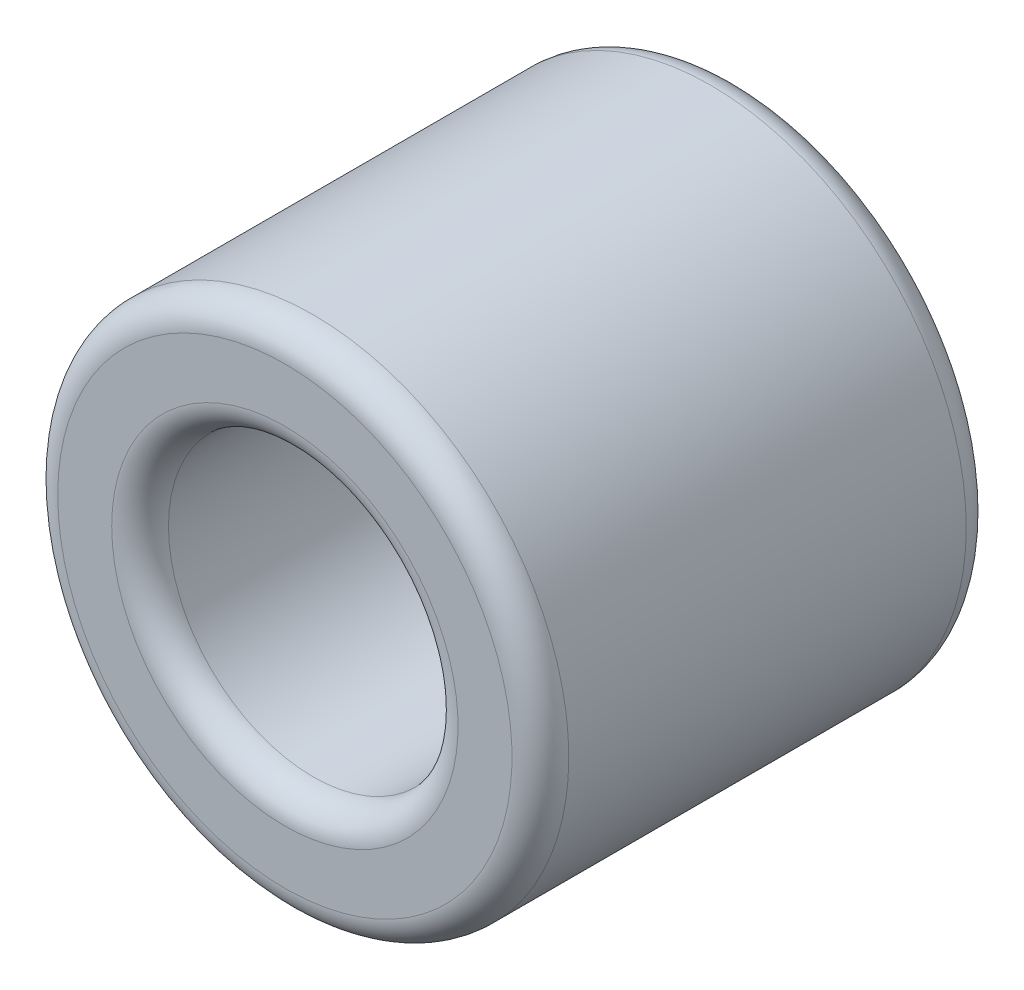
ISO-10303-21;
HEADER;
FILE_DESCRIPTION(('STEP AP214'),'2;1');
FILE_NAME('part.step','',(''),(''),'','','');
FILE_SCHEMA(('AUTOMOTIVE_DESIGN { 1 0 10303 214 1 1 1 1 }'));
ENDSEC;
DATA;
#1=APPLICATION_CONTEXT('core data for automotive mechanical design processes');
#2=APPLICATION_PROTOCOL_DEFINITION('international standard','automotive_design',2000,#1);
#3=PRODUCT_CONTEXT('',#1,'mechanical');
#4=PRODUCT('Part','Part','',(#3));
#5=PRODUCT_RELATED_PRODUCT_CATEGORY('part','',(#4));
#6=PRODUCT_DEFINITION_FORMATION('','',#4);
#7=PRODUCT_DEFINITION_CONTEXT('part definition',#1,'design');
#8=PRODUCT_DEFINITION('design','',#6,#7);
#9=PRODUCT_DEFINITION_SHAPE('','',#8);
#10=(LENGTH_UNIT() NAMED_UNIT(*) SI_UNIT(.MILLI.,.METRE.));
#11=(NAMED_UNIT(*) PLANE_ANGLE_UNIT() SI_UNIT($,.RADIAN.));
#12=(NAMED_UNIT(*) SI_UNIT($,.STERADIAN.) SOLID_ANGLE_UNIT());
#13=UNCERTAINTY_MEASURE_WITH_UNIT(LENGTH_MEASURE(1.E-05),#10,'distance_accuracy_value','');
#14=(GEOMETRIC_REPRESENTATION_CONTEXT(3) GLOBAL_UNCERTAINTY_ASSIGNED_CONTEXT((#13)) GLOBAL_UNIT_ASSIGNED_CONTEXT((#10,
#11,#12)) REPRESENTATION_CONTEXT('',''));
#15=CARTESIAN_POINT('',(0.,0.,0.));
#16=DIRECTION('',(0.,0.,1.));
#17=DIRECTION('',(1.,0.,0.));
#18=AXIS2_PLACEMENT_3D('',#15,#16,#17);
#19=CARTESIAN_POINT('',(0.,4.5,4.));
#20=DIRECTION('',(0.,0.,-1.));
#21=DIRECTION('',(-1.,0.,0.));
#22=AXIS2_PLACEMENT_3D('',#19,#20,#21);
#23=PLANE('',#22);
#24=CARTESIAN_POINT('',(0.,0.,4.));
#25=DIRECTION('',(0.,0.,-1.));
#26=DIRECTION('',(-1.,0.,0.));
#27=AXIS2_PLACEMENT_3D('',#24,#25,#26);
#28=CIRCLE('',#27,4.);
#29=CARTESIAN_POINT('',(-4.,0.,4.));
#30=VERTEX_POINT('',#29);
#31=EDGE_CURVE('E40',#30,#30,#28,.F.);
#32=ORIENTED_EDGE('',*,*,#31,.T.);
#33=EDGE_LOOP('',(#32));
#34=FACE_BOUND('',#33,.T.);
#35=CARTESIAN_POINT('',(0.,0.,4.));
#36=DIRECTION('',(0.,0.,-1.));
#37=DIRECTION('',(-1.,0.,0.));
#38=AXIS2_PLACEMENT_3D('',#35,#36,#37);
#39=CIRCLE('',#38,3.05);
#40=CARTESIAN_POINT('',(-3.05,0.,4.));
#41=VERTEX_POINT('',#40);
#42=EDGE_CURVE('E44',#41,#41,#39,.T.);
#43=ORIENTED_EDGE('',*,*,#42,.T.);
#44=EDGE_LOOP('',(#43));
#45=FACE_BOUND('',#44,.T.);
#46=ADVANCED_FACE('F29',(#34,#45),#23,.F.);
#47=CARTESIAN_POINT('',(0.,0.,4.));
#48=DIRECTION('',(0.,0.,1.));
#49=DIRECTION('',(1.,0.,0.));
#50=AXIS2_PLACEMENT_3D('',#47,#48,#49);
#51=CYLINDRICAL_SURFACE('',#50,2.55);
#52=CARTESIAN_POINT('',(0.,0.,3.5));
#53=DIRECTION('',(0.,0.,-1.));
#54=DIRECTION('',(-1.,0.,0.));
#55=AXIS2_PLACEMENT_3D('',#52,#53,#54);
#56=CIRCLE('',#55,2.55);
#57=CARTESIAN_POINT('',(-2.55,0.,3.5));
#58=VERTEX_POINT('',#57);
#59=EDGE_CURVE('E10',#58,#58,#56,.F.);
#60=ORIENTED_EDGE('',*,*,#59,.T.);
#61=EDGE_LOOP('',(#60));
#62=FACE_BOUND('',#61,.T.);
#63=CARTESIAN_POINT('',(0.,0.,-3.5));
#64=DIRECTION('',(0.,0.,1.));
#65=DIRECTION('',(1.,0.,0.));
#66=AXIS2_PLACEMENT_3D('',#63,#64,#65);
#67=CIRCLE('',#66,2.55);
#68=CARTESIAN_POINT('',(2.55,0.,-3.5));
#69=VERTEX_POINT('',#68);
#70=EDGE_CURVE('E36',#69,#69,#67,.F.);
#71=ORIENTED_EDGE('',*,*,#70,.T.);
#72=EDGE_LOOP('',(#71));
#73=FACE_BOUND('',#72,.T.);
#74=ADVANCED_FACE('F74',(#62,#73),#51,.F.);
#75=CARTESIAN_POINT('',(0.,2.55,-4.));
#76=DIRECTION('',(0.,0.,1.));
#77=DIRECTION('',(1.,0.,0.));
#78=AXIS2_PLACEMENT_3D('',#75,#76,#77);
#79=PLANE('',#78);
#80=CARTESIAN_POINT('',(0.,0.,-4.));
#81=DIRECTION('',(0.,0.,1.));
#82=DIRECTION('',(1.,0.,0.));
#83=AXIS2_PLACEMENT_3D('',#80,#81,#82);
#84=CIRCLE('',#83,4.);
#85=CARTESIAN_POINT('',(4.,0.,-4.));
#86=VERTEX_POINT('',#85);
#87=EDGE_CURVE('E49',#86,#86,#84,.F.);
#88=ORIENTED_EDGE('',*,*,#87,.T.);
#89=EDGE_LOOP('',(#88));
#90=FACE_BOUND('',#89,.T.);
#91=CARTESIAN_POINT('',(0.,0.,-4.));
#92=DIRECTION('',(0.,0.,1.));
#93=DIRECTION('',(1.,0.,0.));
#94=AXIS2_PLACEMENT_3D('',#91,#92,#93);
#95=CIRCLE('',#94,3.05);
#96=CARTESIAN_POINT('',(3.05,0.,-4.));
#97=VERTEX_POINT('',#96);
#98=EDGE_CURVE('E52',#97,#97,#95,.T.);
#99=ORIENTED_EDGE('',*,*,#98,.T.);
#100=EDGE_LOOP('',(#99));
#101=FACE_BOUND('',#100,.T.);
#102=ADVANCED_FACE('F90',(#90,#101),#79,.F.);
#103=CARTESIAN_POINT('',(0.,0.,4.));
#104=DIRECTION('',(0.,0.,1.));
#105=DIRECTION('',(1.,0.,0.));
#106=AXIS2_PLACEMENT_3D('',#103,#104,#105);
#107=CYLINDRICAL_SURFACE('',#106,4.5);
#108=CARTESIAN_POINT('',(0.,0.,-3.5));
#109=DIRECTION('',(0.,0.,1.));
#110=DIRECTION('',(1.,0.,0.));
#111=AXIS2_PLACEMENT_3D('',#108,#109,#110);
#112=CIRCLE('',#111,4.5);
#113=CARTESIAN_POINT('',(4.5,0.,-3.5));
#114=VERTEX_POINT('',#113);
#115=EDGE_CURVE('E55',#114,#114,#112,.T.);
#116=ORIENTED_EDGE('',*,*,#115,.T.);
#117=EDGE_LOOP('',(#116));
#118=FACE_BOUND('',#117,.T.);
#119=CARTESIAN_POINT('',(0.,0.,3.5));
#120=DIRECTION('',(0.,0.,-1.));
#121=DIRECTION('',(-1.,0.,0.));
#122=AXIS2_PLACEMENT_3D('',#119,#120,#121);
#123=CIRCLE('',#122,4.5);
#124=CARTESIAN_POINT('',(-4.5,0.,3.5));
#125=VERTEX_POINT('',#124);
#126=EDGE_CURVE('E58',#125,#125,#123,.T.);
#127=ORIENTED_EDGE('',*,*,#126,.T.);
#128=EDGE_LOOP('',(#127));
#129=FACE_BOUND('',#128,.T.);
#130=ADVANCED_FACE('F62',(#118,#129),#107,.T.);
#131=CARTESIAN_POINT('',(0.,0.,-3.5));
#132=DIRECTION('',(0.,0.,1.));
#133=DIRECTION('',(1.,0.,0.));
#134=AXIS2_PLACEMENT_3D('',#131,#132,#133);
#135=TOROIDAL_SURFACE('',#134,4.,0.5);
#136=ORIENTED_EDGE('',*,*,#87,.F.);
#137=EDGE_LOOP('',(#136));
#138=FACE_BOUND('',#137,.T.);
#139=ORIENTED_EDGE('',*,*,#115,.F.);
#140=EDGE_LOOP('',(#139));
#141=FACE_BOUND('',#140,.T.);
#142=ADVANCED_FACE('F68',(#138,#141),#135,.T.);
#143=CARTESIAN_POINT('',(0.,0.,3.5));
#144=DIRECTION('',(0.,0.,-1.));
#145=DIRECTION('',(-1.,0.,0.));
#146=AXIS2_PLACEMENT_3D('',#143,#144,#145);
#147=TOROIDAL_SURFACE('',#146,4.,0.5);
#148=ORIENTED_EDGE('',*,*,#126,.F.);
#149=EDGE_LOOP('',(#148));
#150=FACE_BOUND('',#149,.T.);
#151=ORIENTED_EDGE('',*,*,#31,.F.);
#152=EDGE_LOOP('',(#151));
#153=FACE_BOUND('',#152,.T.);
#154=ADVANCED_FACE('F64',(#150,#153),#147,.T.);
#155=CARTESIAN_POINT('',(0.,0.,3.5));
#156=DIRECTION('',(0.,0.,-1.));
#157=DIRECTION('',(-1.,0.,0.));
#158=AXIS2_PLACEMENT_3D('',#155,#156,#157);
#159=TOROIDAL_SURFACE('',#158,3.05,0.5);
#160=ORIENTED_EDGE('',*,*,#42,.F.);
#161=EDGE_LOOP('',(#160));
#162=FACE_BOUND('',#161,.T.);
#163=ORIENTED_EDGE('',*,*,#59,.F.);
#164=EDGE_LOOP('',(#163));
#165=FACE_BOUND('',#164,.T.);
#166=ADVANCED_FACE('F67',(#162,#165),#159,.T.);
#167=CARTESIAN_POINT('',(0.,0.,-3.5));
#168=DIRECTION('',(0.,0.,1.));
#169=DIRECTION('',(1.,0.,0.));
#170=AXIS2_PLACEMENT_3D('',#167,#168,#169);
#171=TOROIDAL_SURFACE('',#170,3.05,0.5);
#172=ORIENTED_EDGE('',*,*,#70,.F.);
#173=EDGE_LOOP('',(#172));
#174=FACE_BOUND('',#173,.T.);
#175=ORIENTED_EDGE('',*,*,#98,.F.);
#176=EDGE_LOOP('',(#175));
#177=FACE_BOUND('',#176,.T.);
#178=ADVANCED_FACE('F31',(#174,#177),#171,.T.);
#179=CLOSED_SHELL('',(#46,#74,#102,#130,#142,#154,#166,#178));
#180=MANIFOLD_SOLID_BREP('B2',#179);
#181=ADVANCED_BREP_SHAPE_REPRESENTATION('',(#18,#180),#14);
#182=SHAPE_DEFINITION_REPRESENTATION(#9,#181);
ENDSEC;
END-ISO-10303-21;
